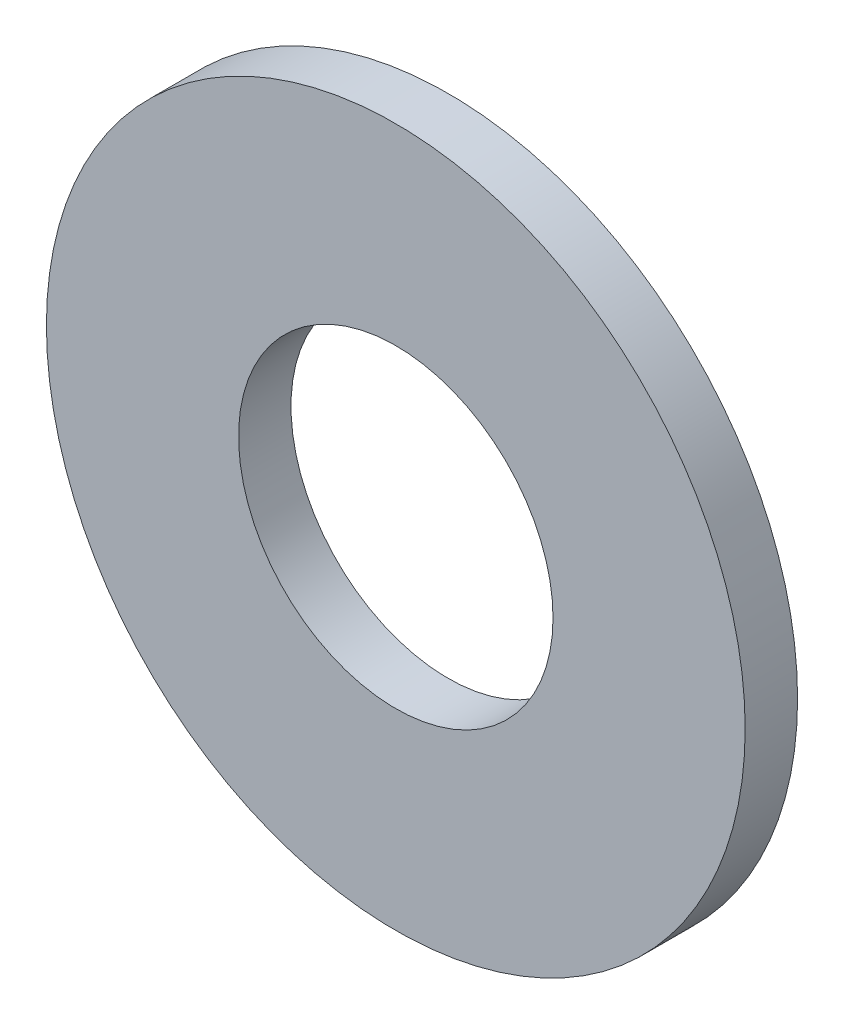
from build123d import *

# Parameters (mm, degrees)
SKETCH1_R          = 2
SKETCH1_R_2        = 0.9
BASE_EXTRUDE_DEPTH = 0.3


with BuildPart() as part:
    # Sketch1 → Base-Extrude (new body)
    with BuildSketch(Plane.XY):
        Circle(SKETCH1_R)
        Circle(SKETCH1_R_2, mode=Mode.SUBTRACT)
    extrude(amount=-BASE_EXTRUDE_DEPTH)


solid = part.part
